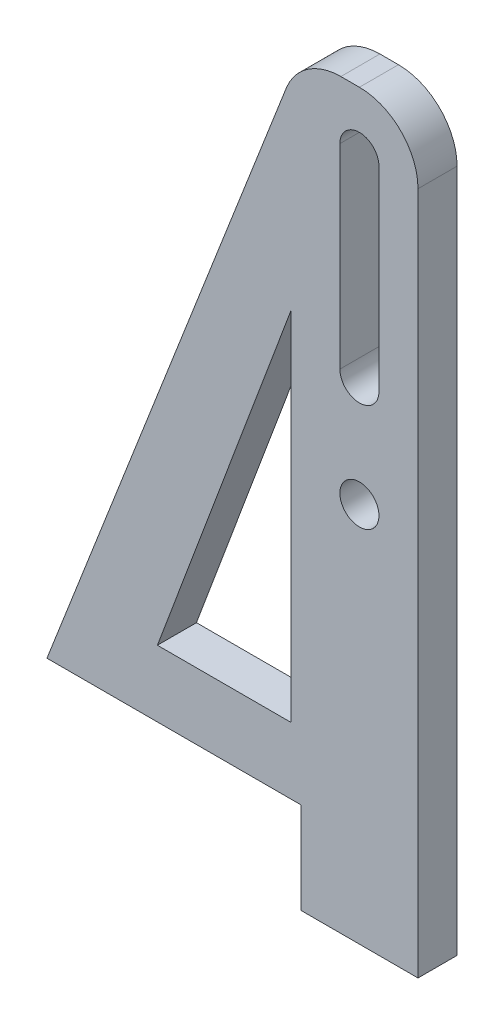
ISO-10303-21;
HEADER;
FILE_DESCRIPTION(('STEP AP214'),'2;1');
FILE_NAME('part.step','',(''),(''),'','','');
FILE_SCHEMA(('AUTOMOTIVE_DESIGN { 1 0 10303 214 1 1 1 1 }'));
ENDSEC;
DATA;
#1=APPLICATION_CONTEXT('core data for automotive mechanical design processes');
#2=APPLICATION_PROTOCOL_DEFINITION('international standard','automotive_design',2000,#1);
#3=PRODUCT_CONTEXT('',#1,'mechanical');
#4=PRODUCT('Part','Part','',(#3));
#5=PRODUCT_RELATED_PRODUCT_CATEGORY('part','',(#4));
#6=PRODUCT_DEFINITION_FORMATION('','',#4);
#7=PRODUCT_DEFINITION_CONTEXT('part definition',#1,'design');
#8=PRODUCT_DEFINITION('design','',#6,#7);
#9=PRODUCT_DEFINITION_SHAPE('','',#8);
#10=(LENGTH_UNIT() NAMED_UNIT(*) SI_UNIT(.MILLI.,.METRE.));
#11=(NAMED_UNIT(*) PLANE_ANGLE_UNIT() SI_UNIT($,.RADIAN.));
#12=(NAMED_UNIT(*) SI_UNIT($,.STERADIAN.) SOLID_ANGLE_UNIT());
#13=UNCERTAINTY_MEASURE_WITH_UNIT(LENGTH_MEASURE(1.E-05),#10,'distance_accuracy_value','');
#14=(GEOMETRIC_REPRESENTATION_CONTEXT(3) GLOBAL_UNCERTAINTY_ASSIGNED_CONTEXT((#13)) GLOBAL_UNIT_ASSIGNED_CONTEXT((#10,
#11,#12)) REPRESENTATION_CONTEXT('',''));
#15=CARTESIAN_POINT('',(0.,0.,0.));
#16=DIRECTION('',(0.,0.,1.));
#17=DIRECTION('',(1.,0.,0.));
#18=AXIS2_PLACEMENT_3D('',#15,#16,#17);
#19=CARTESIAN_POINT('',(0.,0.,2.));
#20=DIRECTION('',(0.,0.,-1.));
#21=DIRECTION('',(-1.,0.,0.));
#22=AXIS2_PLACEMENT_3D('',#19,#20,#21);
#23=PLANE('',#22);
#24=CARTESIAN_POINT('',(15.,35.7013865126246,2.));
#25=DIRECTION('',(0.,0.,1.));
#26=DIRECTION('',(1.,0.,0.));
#27=AXIS2_PLACEMENT_3D('',#24,#25,#26);
#28=CIRCLE('',#27,1.);
#29=CARTESIAN_POINT('',(16.,35.7013865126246,2.));
#30=VERTEX_POINT('',#29);
#31=EDGE_CURVE('E174',#30,#30,#28,.T.);
#32=ORIENTED_EDGE('',*,*,#31,.F.);
#33=EDGE_LOOP('',(#32));
#34=FACE_BOUND('',#33,.T.);
#35=CARTESIAN_POINT('',(15.,51.2013865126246,2.));
#36=DIRECTION('',(0.,0.,1.));
#37=DIRECTION('',(1.,0.,0.));
#38=AXIS2_PLACEMENT_3D('',#35,#36,#37);
#39=CIRCLE('',#38,0.999999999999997);
#40=CARTESIAN_POINT('',(16.,51.2013865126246,2.));
#41=VERTEX_POINT('',#40);
#42=CARTESIAN_POINT('',(14.,51.2013865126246,2.));
#43=VERTEX_POINT('',#42);
#44=EDGE_CURVE('E180',#41,#43,#39,.T.);
#45=ORIENTED_EDGE('',*,*,#44,.F.);
#46=DIRECTION('',(0.,1.,0.));
#47=VECTOR('',#46,1.);
#48=CARTESIAN_POINT('',(16.,51.2013865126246,2.));
#49=LINE('',#48,#47);
#50=CARTESIAN_POINT('',(16.,41.2013865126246,2.));
#51=VERTEX_POINT('',#50);
#52=EDGE_CURVE('E188',#51,#41,#49,.T.);
#53=ORIENTED_EDGE('',*,*,#52,.F.);
#54=CARTESIAN_POINT('',(15.,41.2013865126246,2.));
#55=DIRECTION('',(0.,0.,1.));
#56=DIRECTION('',(1.,0.,0.));
#57=AXIS2_PLACEMENT_3D('',#54,#55,#56);
#58=CIRCLE('',#57,0.999999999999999);
#59=CARTESIAN_POINT('',(14.,41.2013865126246,2.));
#60=VERTEX_POINT('',#59);
#61=EDGE_CURVE('E185',#60,#51,#58,.T.);
#62=ORIENTED_EDGE('',*,*,#61,.F.);
#63=DIRECTION('',(0.,-1.,0.));
#64=VECTOR('',#63,1.);
#65=CARTESIAN_POINT('',(14.,51.2013865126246,2.));
#66=LINE('',#65,#64);
#67=EDGE_CURVE('E182',#43,#60,#66,.T.);
#68=ORIENTED_EDGE('',*,*,#67,.F.);
#69=EDGE_LOOP('',(#45,#53,#62,#68));
#70=FACE_BOUND('',#69,.T.);
#71=DIRECTION('',(-1.,0.,0.));
#72=VECTOR('',#71,1.);
#73=CARTESIAN_POINT('',(12.,54.2013865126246,2.));
#74=LINE('',#73,#72);
#75=CARTESIAN_POINT('',(15.,54.2013865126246,2.));
#76=VERTEX_POINT('',#75);
#77=CARTESIAN_POINT('',(14.0497729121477,54.2013865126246,2.));
#78=VERTEX_POINT('',#77);
#79=EDGE_CURVE('E219',#76,#78,#74,.T.);
#80=ORIENTED_EDGE('',*,*,#79,.T.);
#81=CARTESIAN_POINT('',(14.0497729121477,51.2013865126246,2.));
#82=DIRECTION('',(0.,0.,-1.));
#83=DIRECTION('',(-1.,0.,0.));
#84=AXIS2_PLACEMENT_3D('',#81,#82,#83);
#85=CIRCLE('',#84,3.);
#86=CARTESIAN_POINT('',(11.2549602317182,52.2918094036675,2.));
#87=VERTEX_POINT('',#86);
#88=EDGE_CURVE('E40',#78,#87,#85,.F.);
#89=ORIENTED_EDGE('',*,*,#88,.T.);
#90=DIRECTION('',(-0.363474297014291,-0.931604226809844,0.));
#91=VECTOR('',#90,1.);
#92=CARTESIAN_POINT('',(12.,54.2013865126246,2.));
#93=LINE('',#92,#91);
#94=CARTESIAN_POINT('',(-1.,20.8816853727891,2.));
#95=VERTEX_POINT('',#94);
#96=EDGE_CURVE('E221',#87,#95,#93,.T.);
#97=ORIENTED_EDGE('',*,*,#96,.T.);
#98=DIRECTION('',(1.,0.,0.));
#99=VECTOR('',#98,1.);
#100=CARTESIAN_POINT('',(-1.,20.8816853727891,2.));
#101=LINE('',#100,#99);
#102=CARTESIAN_POINT('',(12.,20.8816853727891,2.));
#103=VERTEX_POINT('',#102);
#104=EDGE_CURVE('E223',#95,#103,#101,.T.);
#105=ORIENTED_EDGE('',*,*,#104,.T.);
#106=DIRECTION('',(0.,-1.,0.));
#107=VECTOR('',#106,1.);
#108=CARTESIAN_POINT('',(12.,16.2013865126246,2.));
#109=LINE('',#108,#107);
#110=CARTESIAN_POINT('',(12.,16.2013865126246,2.));
#111=VERTEX_POINT('',#110);
#112=EDGE_CURVE('E211',#103,#111,#109,.T.);
#113=ORIENTED_EDGE('',*,*,#112,.T.);
#114=DIRECTION('',(1.,0.,0.));
#115=VECTOR('',#114,1.);
#116=CARTESIAN_POINT('',(12.,16.2013865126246,2.));
#117=LINE('',#116,#115);
#118=CARTESIAN_POINT('',(18.,16.2013865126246,2.));
#119=VERTEX_POINT('',#118);
#120=EDGE_CURVE('E214',#111,#119,#117,.T.);
#121=ORIENTED_EDGE('',*,*,#120,.T.);
#122=DIRECTION('',(0.,1.,0.));
#123=VECTOR('',#122,1.);
#124=CARTESIAN_POINT('',(18.,16.2013865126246,2.));
#125=LINE('',#124,#123);
#126=CARTESIAN_POINT('',(18.,51.2013865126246,2.));
#127=VERTEX_POINT('',#126);
#128=EDGE_CURVE('E217',#119,#127,#125,.T.);
#129=ORIENTED_EDGE('',*,*,#128,.T.);
#130=CARTESIAN_POINT('',(15.,51.2013865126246,2.));
#131=DIRECTION('',(0.,0.,-1.));
#132=DIRECTION('',(-1.,0.,0.));
#133=AXIS2_PLACEMENT_3D('',#130,#131,#132);
#134=CIRCLE('',#133,3.);
#135=EDGE_CURVE('E259',#127,#76,#134,.F.);
#136=ORIENTED_EDGE('',*,*,#135,.T.);
#137=EDGE_LOOP('',(#80,#89,#97,#105,#113,#121,#129,#136));
#138=FACE_BOUND('',#137,.T.);
#139=DIRECTION('',(0.,1.,0.));
#140=VECTOR('',#139,1.);
#141=CARTESIAN_POINT('',(11.5,24.2851668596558,2.));
#142=LINE('',#141,#140);
#143=CARTESIAN_POINT('',(11.5,24.2851668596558,2.));
#144=VERTEX_POINT('',#143);
#145=CARTESIAN_POINT('',(11.5,42.5546376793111,2.));
#146=VERTEX_POINT('',#145);
#147=EDGE_CURVE('E142',#144,#146,#142,.T.);
#148=ORIENTED_EDGE('',*,*,#147,.F.);
#149=DIRECTION('',(1.,0.,0.));
#150=VECTOR('',#149,1.);
#151=CARTESIAN_POINT('',(4.65578847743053,24.2851668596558,2.));
#152=LINE('',#151,#150);
#153=CARTESIAN_POINT('',(4.65578847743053,24.2851668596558,2.));
#154=VERTEX_POINT('',#153);
#155=EDGE_CURVE('E163',#154,#144,#152,.T.);
#156=ORIENTED_EDGE('',*,*,#155,.F.);
#157=DIRECTION('',(-0.350816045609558,-0.936444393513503,0.));
#158=VECTOR('',#157,1.);
#159=CARTESIAN_POINT('',(11.5,42.5546376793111,2.));
#160=LINE('',#159,#158);
#161=EDGE_CURVE('E152',#146,#154,#160,.T.);
#162=ORIENTED_EDGE('',*,*,#161,.F.);
#163=EDGE_LOOP('',(#148,#156,#162));
#164=FACE_BOUND('',#163,.T.);
#165=ADVANCED_FACE('F32',(#34,#70,#138,#164),#23,.F.);
#166=CARTESIAN_POINT('',(0.,0.,0.));
#167=DIRECTION('',(0.,0.,-1.));
#168=DIRECTION('',(-1.,0.,0.));
#169=AXIS2_PLACEMENT_3D('',#166,#167,#168);
#170=PLANE('',#169);
#171=DIRECTION('',(0.,1.,0.));
#172=VECTOR('',#171,1.);
#173=CARTESIAN_POINT('',(16.,51.2013865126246,0.));
#174=LINE('',#173,#172);
#175=CARTESIAN_POINT('',(16.,41.2013865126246,0.));
#176=VERTEX_POINT('',#175);
#177=CARTESIAN_POINT('',(16.,51.2013865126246,0.));
#178=VERTEX_POINT('',#177);
#179=EDGE_CURVE('E183',#176,#178,#174,.T.);
#180=ORIENTED_EDGE('',*,*,#179,.T.);
#181=CARTESIAN_POINT('',(15.,51.2013865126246,0.));
#182=DIRECTION('',(0.,0.,1.));
#183=DIRECTION('',(1.,0.,0.));
#184=AXIS2_PLACEMENT_3D('',#181,#182,#183);
#185=CIRCLE('',#184,0.999999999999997);
#186=CARTESIAN_POINT('',(14.,51.2013865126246,0.));
#187=VERTEX_POINT('',#186);
#188=EDGE_CURVE('E177',#178,#187,#185,.T.);
#189=ORIENTED_EDGE('',*,*,#188,.T.);
#190=DIRECTION('',(0.,-1.,0.));
#191=VECTOR('',#190,1.);
#192=CARTESIAN_POINT('',(14.,51.2013865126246,0.));
#193=LINE('',#192,#191);
#194=CARTESIAN_POINT('',(14.,41.2013865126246,0.));
#195=VERTEX_POINT('',#194);
#196=EDGE_CURVE('E193',#187,#195,#193,.T.);
#197=ORIENTED_EDGE('',*,*,#196,.T.);
#198=CARTESIAN_POINT('',(15.,41.2013865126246,0.));
#199=DIRECTION('',(0.,0.,1.));
#200=DIRECTION('',(1.,0.,0.));
#201=AXIS2_PLACEMENT_3D('',#198,#199,#200);
#202=CIRCLE('',#201,0.999999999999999);
#203=EDGE_CURVE('E196',#195,#176,#202,.T.);
#204=ORIENTED_EDGE('',*,*,#203,.T.);
#205=EDGE_LOOP('',(#180,#189,#197,#204));
#206=FACE_BOUND('',#205,.T.);
#207=DIRECTION('',(-0.363474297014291,-0.931604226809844,0.));
#208=VECTOR('',#207,1.);
#209=CARTESIAN_POINT('',(12.,54.2013865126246,0.));
#210=LINE('',#209,#208);
#211=CARTESIAN_POINT('',(11.2549602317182,52.2918094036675,0.));
#212=VERTEX_POINT('',#211);
#213=CARTESIAN_POINT('',(-1.,20.8816853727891,0.));
#214=VERTEX_POINT('',#213);
#215=EDGE_CURVE('E234',#212,#214,#210,.T.);
#216=ORIENTED_EDGE('',*,*,#215,.F.);
#217=CARTESIAN_POINT('',(14.0497729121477,51.2013865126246,0.));
#218=DIRECTION('',(0.,0.,-1.));
#219=DIRECTION('',(-1.,0.,0.));
#220=AXIS2_PLACEMENT_3D('',#217,#218,#219);
#221=CIRCLE('',#220,3.);
#222=CARTESIAN_POINT('',(14.0497729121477,54.2013865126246,0.));
#223=VERTEX_POINT('',#222);
#224=EDGE_CURVE('E253',#212,#223,#221,.T.);
#225=ORIENTED_EDGE('',*,*,#224,.T.);
#226=DIRECTION('',(-1.,0.,0.));
#227=VECTOR('',#226,1.);
#228=CARTESIAN_POINT('',(12.,54.2013865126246,0.));
#229=LINE('',#228,#227);
#230=CARTESIAN_POINT('',(15.,54.2013865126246,0.));
#231=VERTEX_POINT('',#230);
#232=EDGE_CURVE('E232',#231,#223,#229,.T.);
#233=ORIENTED_EDGE('',*,*,#232,.F.);
#234=CARTESIAN_POINT('',(15.,51.2013865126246,0.));
#235=DIRECTION('',(0.,0.,-1.));
#236=DIRECTION('',(-1.,0.,0.));
#237=AXIS2_PLACEMENT_3D('',#234,#235,#236);
#238=CIRCLE('',#237,3.);
#239=CARTESIAN_POINT('',(18.,51.2013865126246,0.));
#240=VERTEX_POINT('',#239);
#241=EDGE_CURVE('E251',#231,#240,#238,.T.);
#242=ORIENTED_EDGE('',*,*,#241,.T.);
#243=DIRECTION('',(0.,1.,0.));
#244=VECTOR('',#243,1.);
#245=CARTESIAN_POINT('',(18.,16.2013865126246,0.));
#246=LINE('',#245,#244);
#247=CARTESIAN_POINT('',(18.,16.2013865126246,0.));
#248=VERTEX_POINT('',#247);
#249=EDGE_CURVE('E230',#248,#240,#246,.T.);
#250=ORIENTED_EDGE('',*,*,#249,.F.);
#251=DIRECTION('',(1.,0.,0.));
#252=VECTOR('',#251,1.);
#253=CARTESIAN_POINT('',(12.,16.2013865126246,0.));
#254=LINE('',#253,#252);
#255=CARTESIAN_POINT('',(12.,16.2013865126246,0.));
#256=VERTEX_POINT('',#255);
#257=EDGE_CURVE('E228',#256,#248,#254,.T.);
#258=ORIENTED_EDGE('',*,*,#257,.F.);
#259=DIRECTION('',(0.,-1.,0.));
#260=VECTOR('',#259,1.);
#261=CARTESIAN_POINT('',(12.,16.2013865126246,0.));
#262=LINE('',#261,#260);
#263=CARTESIAN_POINT('',(12.,20.8816853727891,0.));
#264=VERTEX_POINT('',#263);
#265=EDGE_CURVE('E210',#264,#256,#262,.T.);
#266=ORIENTED_EDGE('',*,*,#265,.F.);
#267=DIRECTION('',(1.,0.,0.));
#268=VECTOR('',#267,1.);
#269=CARTESIAN_POINT('',(-1.,20.8816853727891,0.));
#270=LINE('',#269,#268);
#271=EDGE_CURVE('E215',#214,#264,#270,.T.);
#272=ORIENTED_EDGE('',*,*,#271,.F.);
#273=EDGE_LOOP('',(#216,#225,#233,#242,#250,#258,#266,#272));
#274=FACE_BOUND('',#273,.T.);
#275=CARTESIAN_POINT('',(15.,35.7013865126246,0.));
#276=DIRECTION('',(0.,0.,1.));
#277=DIRECTION('',(1.,0.,0.));
#278=AXIS2_PLACEMENT_3D('',#275,#276,#277);
#279=CIRCLE('',#278,1.);
#280=CARTESIAN_POINT('',(16.,35.7013865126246,0.));
#281=VERTEX_POINT('',#280);
#282=EDGE_CURVE('E160',#281,#281,#279,.T.);
#283=ORIENTED_EDGE('',*,*,#282,.T.);
#284=EDGE_LOOP('',(#283));
#285=FACE_BOUND('',#284,.T.);
#286=DIRECTION('',(1.,0.,0.));
#287=VECTOR('',#286,1.);
#288=CARTESIAN_POINT('',(4.65578847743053,24.2851668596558,0.));
#289=LINE('',#288,#287);
#290=CARTESIAN_POINT('',(4.65578847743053,24.2851668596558,0.));
#291=VERTEX_POINT('',#290);
#292=CARTESIAN_POINT('',(11.5,24.2851668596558,0.));
#293=VERTEX_POINT('',#292);
#294=EDGE_CURVE('E153',#291,#293,#289,.T.);
#295=ORIENTED_EDGE('',*,*,#294,.T.);
#296=DIRECTION('',(0.,1.,0.));
#297=VECTOR('',#296,1.);
#298=CARTESIAN_POINT('',(11.5,24.2851668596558,0.));
#299=LINE('',#298,#297);
#300=CARTESIAN_POINT('',(11.5,42.5546376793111,0.));
#301=VERTEX_POINT('',#300);
#302=EDGE_CURVE('E167',#293,#301,#299,.T.);
#303=ORIENTED_EDGE('',*,*,#302,.T.);
#304=DIRECTION('',(-0.350816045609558,-0.936444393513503,0.));
#305=VECTOR('',#304,1.);
#306=CARTESIAN_POINT('',(11.5,42.5546376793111,0.));
#307=LINE('',#306,#305);
#308=EDGE_CURVE('E159',#301,#291,#307,.T.);
#309=ORIENTED_EDGE('',*,*,#308,.T.);
#310=EDGE_LOOP('',(#295,#303,#309));
#311=FACE_BOUND('',#310,.T.);
#312=ADVANCED_FACE('F273',(#206,#274,#285,#311),#170,.T.);
#313=CARTESIAN_POINT('',(12.,16.2013865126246,2.));
#314=DIRECTION('',(1.,0.,0.));
#315=DIRECTION('',(0.,1.,0.));
#316=AXIS2_PLACEMENT_3D('',#313,#314,#315);
#317=PLANE('',#316);
#318=ORIENTED_EDGE('',*,*,#265,.T.);
#319=DIRECTION('',(0.,0.,-1.));
#320=VECTOR('',#319,1.);
#321=CARTESIAN_POINT('',(12.,16.2013865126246,2.));
#322=LINE('',#321,#320);
#323=EDGE_CURVE('E245',#111,#256,#322,.T.);
#324=ORIENTED_EDGE('',*,*,#323,.F.);
#325=ORIENTED_EDGE('',*,*,#112,.F.);
#326=DIRECTION('',(0.,0.,-1.));
#327=VECTOR('',#326,1.);
#328=CARTESIAN_POINT('',(12.,20.8816853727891,2.));
#329=LINE('',#328,#327);
#330=EDGE_CURVE('E225',#103,#264,#329,.T.);
#331=ORIENTED_EDGE('',*,*,#330,.T.);
#332=EDGE_LOOP('',(#318,#324,#325,#331));
#333=FACE_BOUND('',#332,.T.);
#334=ADVANCED_FACE('F288',(#333),#317,.F.);
#335=CARTESIAN_POINT('',(12.,16.2013865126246,2.));
#336=DIRECTION('',(0.,1.,0.));
#337=DIRECTION('',(0.,0.,1.));
#338=AXIS2_PLACEMENT_3D('',#335,#336,#337);
#339=PLANE('',#338);
#340=ORIENTED_EDGE('',*,*,#257,.T.);
#341=DIRECTION('',(0.,0.,-1.));
#342=VECTOR('',#341,1.);
#343=CARTESIAN_POINT('',(18.,16.2013865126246,2.));
#344=LINE('',#343,#342);
#345=EDGE_CURVE('E242',#119,#248,#344,.T.);
#346=ORIENTED_EDGE('',*,*,#345,.F.);
#347=ORIENTED_EDGE('',*,*,#120,.F.);
#348=ORIENTED_EDGE('',*,*,#323,.T.);
#349=EDGE_LOOP('',(#340,#346,#347,#348));
#350=FACE_BOUND('',#349,.T.);
#351=ADVANCED_FACE('F284',(#350),#339,.F.);
#352=CARTESIAN_POINT('',(18.,16.2013865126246,2.));
#353=DIRECTION('',(-1.,0.,0.));
#354=DIRECTION('',(0.,0.,1.));
#355=AXIS2_PLACEMENT_3D('',#352,#353,#354);
#356=PLANE('',#355);
#357=ORIENTED_EDGE('',*,*,#249,.T.);
#358=DIRECTION('',(0.,0.,-1.));
#359=VECTOR('',#358,1.);
#360=CARTESIAN_POINT('',(18.,51.2013865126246,2.));
#361=LINE('',#360,#359);
#362=EDGE_CURVE('E11',#240,#127,#361,.F.);
#363=ORIENTED_EDGE('',*,*,#362,.T.);
#364=ORIENTED_EDGE('',*,*,#128,.F.);
#365=ORIENTED_EDGE('',*,*,#345,.T.);
#366=EDGE_LOOP('',(#357,#363,#364,#365));
#367=FACE_BOUND('',#366,.T.);
#368=ADVANCED_FACE('F281',(#367),#356,.F.);
#369=CARTESIAN_POINT('',(12.,54.2013865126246,2.));
#370=DIRECTION('',(0.,-1.,0.));
#371=DIRECTION('',(0.,0.,-1.));
#372=AXIS2_PLACEMENT_3D('',#369,#370,#371);
#373=PLANE('',#372);
#374=ORIENTED_EDGE('',*,*,#232,.T.);
#375=DIRECTION('',(0.,0.,-1.));
#376=VECTOR('',#375,1.);
#377=CARTESIAN_POINT('',(14.0497729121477,54.2013865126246,2.));
#378=LINE('',#377,#376);
#379=EDGE_CURVE('E53',#223,#78,#378,.F.);
#380=ORIENTED_EDGE('',*,*,#379,.T.);
#381=ORIENTED_EDGE('',*,*,#79,.F.);
#382=DIRECTION('',(0.,0.,-1.));
#383=VECTOR('',#382,1.);
#384=CARTESIAN_POINT('',(15.,54.2013865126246,2.));
#385=LINE('',#384,#383);
#386=EDGE_CURVE('E255',#76,#231,#385,.T.);
#387=ORIENTED_EDGE('',*,*,#386,.T.);
#388=EDGE_LOOP('',(#374,#380,#381,#387));
#389=FACE_BOUND('',#388,.T.);
#390=ADVANCED_FACE('F276',(#389),#373,.F.);
#391=CARTESIAN_POINT('',(12.,54.2013865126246,2.));
#392=DIRECTION('',(0.931604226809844,-0.363474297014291,0.));
#393=DIRECTION('',(0.363474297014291,0.931604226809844,0.));
#394=AXIS2_PLACEMENT_3D('',#391,#392,#393);
#395=PLANE('',#394);
#396=ORIENTED_EDGE('',*,*,#96,.F.);
#397=DIRECTION('',(0.,0.,-1.));
#398=VECTOR('',#397,1.);
#399=CARTESIAN_POINT('',(11.2549602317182,52.2918094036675,2.));
#400=LINE('',#399,#398);
#401=EDGE_CURVE('E248',#87,#212,#400,.T.);
#402=ORIENTED_EDGE('',*,*,#401,.T.);
#403=ORIENTED_EDGE('',*,*,#215,.T.);
#404=DIRECTION('',(0.,0.,-1.));
#405=VECTOR('',#404,1.);
#406=CARTESIAN_POINT('',(-1.,20.8816853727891,2.));
#407=LINE('',#406,#405);
#408=EDGE_CURVE('E239',#95,#214,#407,.T.);
#409=ORIENTED_EDGE('',*,*,#408,.F.);
#410=EDGE_LOOP('',(#396,#402,#403,#409));
#411=FACE_BOUND('',#410,.T.);
#412=ADVANCED_FACE('F267',(#411),#395,.F.);
#413=CARTESIAN_POINT('',(-1.,20.8816853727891,2.));
#414=DIRECTION('',(0.,1.,0.));
#415=DIRECTION('',(0.,0.,1.));
#416=AXIS2_PLACEMENT_3D('',#413,#414,#415);
#417=PLANE('',#416);
#418=ORIENTED_EDGE('',*,*,#271,.T.);
#419=ORIENTED_EDGE('',*,*,#330,.F.);
#420=ORIENTED_EDGE('',*,*,#104,.F.);
#421=ORIENTED_EDGE('',*,*,#408,.T.);
#422=EDGE_LOOP('',(#418,#419,#420,#421));
#423=FACE_BOUND('',#422,.T.);
#424=ADVANCED_FACE('F292',(#423),#417,.F.);
#425=CARTESIAN_POINT('',(15.,51.2013865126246,2.));
#426=DIRECTION('',(0.,0.,-1.));
#427=DIRECTION('',(-1.,0.,0.));
#428=AXIS2_PLACEMENT_3D('',#425,#426,#427);
#429=CYLINDRICAL_SURFACE('',#428,0.999999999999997);
#430=ORIENTED_EDGE('',*,*,#188,.F.);
#431=DIRECTION('',(0.,0.,-1.));
#432=VECTOR('',#431,1.);
#433=CARTESIAN_POINT('',(16.,51.2013865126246,2.));
#434=LINE('',#433,#432);
#435=EDGE_CURVE('E190',#41,#178,#434,.T.);
#436=ORIENTED_EDGE('',*,*,#435,.F.);
#437=ORIENTED_EDGE('',*,*,#44,.T.);
#438=DIRECTION('',(0.,0.,-1.));
#439=VECTOR('',#438,1.);
#440=CARTESIAN_POINT('',(14.,51.2013865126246,2.));
#441=LINE('',#440,#439);
#442=EDGE_CURVE('E207',#43,#187,#441,.T.);
#443=ORIENTED_EDGE('',*,*,#442,.T.);
#444=EDGE_LOOP('',(#430,#436,#437,#443));
#445=FACE_BOUND('',#444,.T.);
#446=ADVANCED_FACE('F294',(#445),#429,.F.);
#447=CARTESIAN_POINT('',(14.,51.2013865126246,2.));
#448=DIRECTION('',(1.,0.,0.));
#449=DIRECTION('',(0.,0.,-1.));
#450=AXIS2_PLACEMENT_3D('',#447,#448,#449);
#451=PLANE('',#450);
#452=ORIENTED_EDGE('',*,*,#196,.F.);
#453=ORIENTED_EDGE('',*,*,#442,.F.);
#454=ORIENTED_EDGE('',*,*,#67,.T.);
#455=DIRECTION('',(0.,0.,-1.));
#456=VECTOR('',#455,1.);
#457=CARTESIAN_POINT('',(14.,41.2013865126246,2.));
#458=LINE('',#457,#456);
#459=EDGE_CURVE('E205',#60,#195,#458,.T.);
#460=ORIENTED_EDGE('',*,*,#459,.T.);
#461=EDGE_LOOP('',(#452,#453,#454,#460));
#462=FACE_BOUND('',#461,.T.);
#463=ADVANCED_FACE('F300',(#462),#451,.T.);
#464=CARTESIAN_POINT('',(15.,41.2013865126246,2.));
#465=DIRECTION('',(0.,0.,-1.));
#466=DIRECTION('',(-1.,0.,0.));
#467=AXIS2_PLACEMENT_3D('',#464,#465,#466);
#468=CYLINDRICAL_SURFACE('',#467,0.999999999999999);
#469=ORIENTED_EDGE('',*,*,#203,.F.);
#470=ORIENTED_EDGE('',*,*,#459,.F.);
#471=ORIENTED_EDGE('',*,*,#61,.T.);
#472=DIRECTION('',(0.,0.,-1.));
#473=VECTOR('',#472,1.);
#474=CARTESIAN_POINT('',(16.,41.2013865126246,2.));
#475=LINE('',#474,#473);
#476=EDGE_CURVE('E203',#51,#176,#475,.T.);
#477=ORIENTED_EDGE('',*,*,#476,.T.);
#478=EDGE_LOOP('',(#469,#470,#471,#477));
#479=FACE_BOUND('',#478,.T.);
#480=ADVANCED_FACE('F317',(#479),#468,.F.);
#481=CARTESIAN_POINT('',(16.,51.2013865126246,2.));
#482=DIRECTION('',(-1.,0.,0.));
#483=DIRECTION('',(0.,-1.,0.));
#484=AXIS2_PLACEMENT_3D('',#481,#482,#483);
#485=PLANE('',#484);
#486=ORIENTED_EDGE('',*,*,#179,.F.);
#487=ORIENTED_EDGE('',*,*,#476,.F.);
#488=ORIENTED_EDGE('',*,*,#52,.T.);
#489=ORIENTED_EDGE('',*,*,#435,.T.);
#490=EDGE_LOOP('',(#486,#487,#488,#489));
#491=FACE_BOUND('',#490,.T.);
#492=ADVANCED_FACE('F321',(#491),#485,.T.);
#493=CARTESIAN_POINT('',(15.,35.7013865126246,2.));
#494=DIRECTION('',(0.,0.,-1.));
#495=DIRECTION('',(-1.,0.,0.));
#496=AXIS2_PLACEMENT_3D('',#493,#494,#495);
#497=CYLINDRICAL_SURFACE('',#496,1.);
#498=ORIENTED_EDGE('',*,*,#31,.T.);
#499=EDGE_LOOP('',(#498));
#500=FACE_BOUND('',#499,.T.);
#501=ORIENTED_EDGE('',*,*,#282,.F.);
#502=EDGE_LOOP('',(#501));
#503=FACE_BOUND('',#502,.T.);
#504=ADVANCED_FACE('F325',(#500,#503),#497,.F.);
#505=CARTESIAN_POINT('',(11.5,24.2851668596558,2.));
#506=DIRECTION('',(-1.,0.,0.));
#507=DIRECTION('',(0.,0.,1.));
#508=AXIS2_PLACEMENT_3D('',#505,#506,#507);
#509=PLANE('',#508);
#510=ORIENTED_EDGE('',*,*,#302,.F.);
#511=DIRECTION('',(0.,0.,-1.));
#512=VECTOR('',#511,1.);
#513=CARTESIAN_POINT('',(11.5,24.2851668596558,2.));
#514=LINE('',#513,#512);
#515=EDGE_CURVE('E148',#144,#293,#514,.T.);
#516=ORIENTED_EDGE('',*,*,#515,.F.);
#517=ORIENTED_EDGE('',*,*,#147,.T.);
#518=DIRECTION('',(0.,0.,-1.));
#519=VECTOR('',#518,1.);
#520=CARTESIAN_POINT('',(11.5,42.5546376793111,2.));
#521=LINE('',#520,#519);
#522=EDGE_CURVE('E145',#146,#301,#521,.T.);
#523=ORIENTED_EDGE('',*,*,#522,.T.);
#524=EDGE_LOOP('',(#510,#516,#517,#523));
#525=FACE_BOUND('',#524,.T.);
#526=ADVANCED_FACE('F144',(#525),#509,.T.);
#527=CARTESIAN_POINT('',(11.5,42.5546376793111,2.));
#528=DIRECTION('',(0.936444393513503,-0.350816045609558,0.));
#529=DIRECTION('',(0.350816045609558,0.936444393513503,0.));
#530=AXIS2_PLACEMENT_3D('',#527,#528,#529);
#531=PLANE('',#530);
#532=ORIENTED_EDGE('',*,*,#308,.F.);
#533=ORIENTED_EDGE('',*,*,#522,.F.);
#534=ORIENTED_EDGE('',*,*,#161,.T.);
#535=DIRECTION('',(0.,0.,-1.));
#536=VECTOR('',#535,1.);
#537=CARTESIAN_POINT('',(4.65578847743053,24.2851668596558,2.));
#538=LINE('',#537,#536);
#539=EDGE_CURVE('E161',#154,#291,#538,.T.);
#540=ORIENTED_EDGE('',*,*,#539,.T.);
#541=EDGE_LOOP('',(#532,#533,#534,#540));
#542=FACE_BOUND('',#541,.T.);
#543=ADVANCED_FACE('F157',(#542),#531,.T.);
#544=CARTESIAN_POINT('',(4.65578847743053,24.2851668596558,2.));
#545=DIRECTION('',(0.,1.,0.));
#546=DIRECTION('',(0.,0.,1.));
#547=AXIS2_PLACEMENT_3D('',#544,#545,#546);
#548=PLANE('',#547);
#549=ORIENTED_EDGE('',*,*,#294,.F.);
#550=ORIENTED_EDGE('',*,*,#539,.F.);
#551=ORIENTED_EDGE('',*,*,#155,.T.);
#552=ORIENTED_EDGE('',*,*,#515,.T.);
#553=EDGE_LOOP('',(#549,#550,#551,#552));
#554=FACE_BOUND('',#553,.T.);
#555=ADVANCED_FACE('F334',(#554),#548,.T.);
#556=CARTESIAN_POINT('',(14.0497729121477,51.2013865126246,2.));
#557=DIRECTION('',(0.,0.,-1.));
#558=DIRECTION('',(-1.,0.,0.));
#559=AXIS2_PLACEMENT_3D('',#556,#557,#558);
#560=CYLINDRICAL_SURFACE('',#559,3.);
#561=ORIENTED_EDGE('',*,*,#88,.F.);
#562=ORIENTED_EDGE('',*,*,#379,.F.);
#563=ORIENTED_EDGE('',*,*,#224,.F.);
#564=ORIENTED_EDGE('',*,*,#401,.F.);
#565=EDGE_LOOP('',(#561,#562,#563,#564));
#566=FACE_BOUND('',#565,.T.);
#567=ADVANCED_FACE('F270',(#566),#560,.T.);
#568=CARTESIAN_POINT('',(15.,51.2013865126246,2.));
#569=DIRECTION('',(0.,0.,-1.));
#570=DIRECTION('',(-1.,0.,0.));
#571=AXIS2_PLACEMENT_3D('',#568,#569,#570);
#572=CYLINDRICAL_SURFACE('',#571,3.);
#573=ORIENTED_EDGE('',*,*,#135,.F.);
#574=ORIENTED_EDGE('',*,*,#362,.F.);
#575=ORIENTED_EDGE('',*,*,#241,.F.);
#576=ORIENTED_EDGE('',*,*,#386,.F.);
#577=EDGE_LOOP('',(#573,#574,#575,#576));
#578=FACE_BOUND('',#577,.T.);
#579=ADVANCED_FACE('F34',(#578),#572,.T.);
#580=CLOSED_SHELL('',(#165,#312,#334,#351,#368,#390,#412,#424,#446,#463,#480,#492,#504,#526,
#543,#555,#567,#579));
#581=MANIFOLD_SOLID_BREP('B2',#580);
#582=ADVANCED_BREP_SHAPE_REPRESENTATION('',(#18,#581),#14);
#583=SHAPE_DEFINITION_REPRESENTATION(#9,#582);
ENDSEC;
END-ISO-10303-21;
